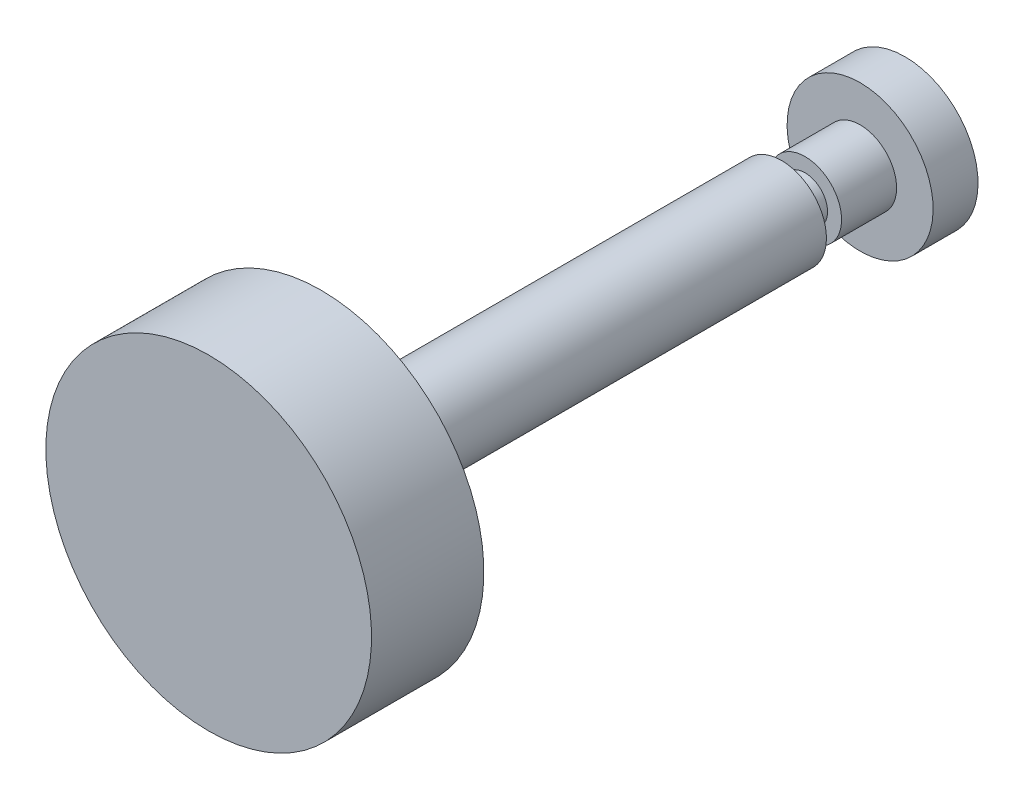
ISO-10303-21;
HEADER;
FILE_DESCRIPTION(('STEP AP214'),'2;1');
FILE_NAME('part.step','',(''),(''),'','','');
FILE_SCHEMA(('AUTOMOTIVE_DESIGN { 1 0 10303 214 1 1 1 1 }'));
ENDSEC;
DATA;
#1=APPLICATION_CONTEXT('core data for automotive mechanical design processes');
#2=APPLICATION_PROTOCOL_DEFINITION('international standard','automotive_design',2000,#1);
#3=PRODUCT_CONTEXT('',#1,'mechanical');
#4=PRODUCT('Part','Part','',(#3));
#5=PRODUCT_RELATED_PRODUCT_CATEGORY('part','',(#4));
#6=PRODUCT_DEFINITION_FORMATION('','',#4);
#7=PRODUCT_DEFINITION_CONTEXT('part definition',#1,'design');
#8=PRODUCT_DEFINITION('design','',#6,#7);
#9=PRODUCT_DEFINITION_SHAPE('','',#8);
#10=(LENGTH_UNIT() NAMED_UNIT(*) SI_UNIT(.MILLI.,.METRE.));
#11=(NAMED_UNIT(*) PLANE_ANGLE_UNIT() SI_UNIT($,.RADIAN.));
#12=(NAMED_UNIT(*) SI_UNIT($,.STERADIAN.) SOLID_ANGLE_UNIT());
#13=UNCERTAINTY_MEASURE_WITH_UNIT(LENGTH_MEASURE(1.E-05),#10,'distance_accuracy_value','');
#14=(GEOMETRIC_REPRESENTATION_CONTEXT(3) GLOBAL_UNCERTAINTY_ASSIGNED_CONTEXT((#13)) GLOBAL_UNIT_ASSIGNED_CONTEXT((#10,
#11,#12)) REPRESENTATION_CONTEXT('',''));
#15=CARTESIAN_POINT('',(0.,0.,0.));
#16=DIRECTION('',(0.,0.,1.));
#17=DIRECTION('',(1.,0.,0.));
#18=AXIS2_PLACEMENT_3D('',#15,#16,#17);
#19=CARTESIAN_POINT('',(0.,0.,0.));
#20=DIRECTION('',(0.,0.,1.));
#21=DIRECTION('',(0.,1.,0.));
#22=AXIS2_PLACEMENT_3D('',#19,#20,#21);
#23=PLANE('',#22);
#24=CARTESIAN_POINT('',(0.,0.,0.));
#25=DIRECTION('',(0.,0.,1.));
#26=DIRECTION('',(0.,1.,0.));
#27=AXIS2_PLACEMENT_3D('',#24,#25,#26);
#28=CIRCLE('',#27,6.5);
#29=CARTESIAN_POINT('',(0.,6.5,0.));
#30=VERTEX_POINT('',#29);
#31=EDGE_CURVE('E8',#30,#30,#28,.T.);
#32=ORIENTED_EDGE('',*,*,#31,.F.);
#33=EDGE_LOOP('',(#32));
#34=FACE_BOUND('',#33,.T.);
#35=ADVANCED_FACE('F12',(#34),#23,.F.);
#36=CARTESIAN_POINT('',(0.,0.,50.));
#37=DIRECTION('',(0.,0.,1.));
#38=DIRECTION('',(0.,1.,0.));
#39=AXIS2_PLACEMENT_3D('',#36,#37,#38);
#40=CYLINDRICAL_SURFACE('',#39,6.5);
#41=CARTESIAN_POINT('',(0.,0.,4.));
#42=DIRECTION('',(0.,0.,1.));
#43=DIRECTION('',(0.,1.,0.));
#44=AXIS2_PLACEMENT_3D('',#41,#42,#43);
#45=CIRCLE('',#44,6.5);
#46=CARTESIAN_POINT('',(0.,6.5,4.));
#47=VERTEX_POINT('',#46);
#48=EDGE_CURVE('E18',#47,#47,#45,.T.);
#49=ORIENTED_EDGE('',*,*,#48,.F.);
#50=EDGE_LOOP('',(#49));
#51=FACE_BOUND('',#50,.T.);
#52=ORIENTED_EDGE('',*,*,#31,.T.);
#53=EDGE_LOOP('',(#52));
#54=FACE_BOUND('',#53,.T.);
#55=ADVANCED_FACE('F71',(#51,#54),#40,.T.);
#56=CARTESIAN_POINT('',(0.,-6.5,4.));
#57=DIRECTION('',(0.,0.,-1.));
#58=DIRECTION('',(0.,-1.,0.));
#59=AXIS2_PLACEMENT_3D('',#56,#57,#58);
#60=PLANE('',#59);
#61=CARTESIAN_POINT('',(0.,0.,4.));
#62=DIRECTION('',(0.,0.,1.));
#63=DIRECTION('',(0.,1.,0.));
#64=AXIS2_PLACEMENT_3D('',#61,#62,#63);
#65=CIRCLE('',#64,3.25);
#66=CARTESIAN_POINT('',(0.,3.25,4.));
#67=VERTEX_POINT('',#66);
#68=EDGE_CURVE('E22',#67,#67,#65,.T.);
#69=ORIENTED_EDGE('',*,*,#68,.F.);
#70=EDGE_LOOP('',(#69));
#71=FACE_BOUND('',#70,.T.);
#72=ORIENTED_EDGE('',*,*,#48,.T.);
#73=EDGE_LOOP('',(#72));
#74=FACE_BOUND('',#73,.T.);
#75=ADVANCED_FACE('F76',(#71,#74),#60,.F.);
#76=CARTESIAN_POINT('',(0.,0.,50.));
#77=DIRECTION('',(0.,0.,1.));
#78=DIRECTION('',(0.,1.,0.));
#79=AXIS2_PLACEMENT_3D('',#76,#77,#78);
#80=CYLINDRICAL_SURFACE('',#79,3.25);
#81=CARTESIAN_POINT('',(0.,0.,8.9));
#82=DIRECTION('',(0.,0.,1.));
#83=DIRECTION('',(0.,1.,0.));
#84=AXIS2_PLACEMENT_3D('',#81,#82,#83);
#85=CIRCLE('',#84,3.25);
#86=CARTESIAN_POINT('',(0.,3.25,8.9));
#87=VERTEX_POINT('',#86);
#88=EDGE_CURVE('E26',#87,#87,#85,.T.);
#89=ORIENTED_EDGE('',*,*,#88,.F.);
#90=EDGE_LOOP('',(#89));
#91=FACE_BOUND('',#90,.T.);
#92=ORIENTED_EDGE('',*,*,#68,.T.);
#93=EDGE_LOOP('',(#92));
#94=FACE_BOUND('',#93,.T.);
#95=ADVANCED_FACE('F81',(#91,#94),#80,.T.);
#96=CARTESIAN_POINT('',(0.,-3.25,8.9));
#97=DIRECTION('',(0.,0.,-1.));
#98=DIRECTION('',(0.,-1.,0.));
#99=AXIS2_PLACEMENT_3D('',#96,#97,#98);
#100=PLANE('',#99);
#101=CARTESIAN_POINT('',(0.,0.,8.9));
#102=DIRECTION('',(0.,0.,1.));
#103=DIRECTION('',(0.,1.,0.));
#104=AXIS2_PLACEMENT_3D('',#101,#102,#103);
#105=CIRCLE('',#104,2.);
#106=CARTESIAN_POINT('',(0.,2.,8.9));
#107=VERTEX_POINT('',#106);
#108=EDGE_CURVE('E31',#107,#107,#105,.T.);
#109=ORIENTED_EDGE('',*,*,#108,.F.);
#110=EDGE_LOOP('',(#109));
#111=FACE_BOUND('',#110,.T.);
#112=ORIENTED_EDGE('',*,*,#88,.T.);
#113=EDGE_LOOP('',(#112));
#114=FACE_BOUND('',#113,.T.);
#115=ADVANCED_FACE('F87',(#111,#114),#100,.F.);
#116=CARTESIAN_POINT('',(0.,0.,50.));
#117=DIRECTION('',(0.,0.,1.));
#118=DIRECTION('',(0.,1.,0.));
#119=AXIS2_PLACEMENT_3D('',#116,#117,#118);
#120=CYLINDRICAL_SURFACE('',#119,2.);
#121=CARTESIAN_POINT('',(0.,0.,11.));
#122=DIRECTION('',(0.,0.,1.));
#123=DIRECTION('',(0.,1.,0.));
#124=AXIS2_PLACEMENT_3D('',#121,#122,#123);
#125=CIRCLE('',#124,2.);
#126=CARTESIAN_POINT('',(0.,2.,11.));
#127=VERTEX_POINT('',#126);
#128=EDGE_CURVE('E34',#127,#127,#125,.T.);
#129=ORIENTED_EDGE('',*,*,#128,.F.);
#130=EDGE_LOOP('',(#129));
#131=FACE_BOUND('',#130,.T.);
#132=ORIENTED_EDGE('',*,*,#108,.T.);
#133=EDGE_LOOP('',(#132));
#134=FACE_BOUND('',#133,.T.);
#135=ADVANCED_FACE('F91',(#131,#134),#120,.T.);
#136=CARTESIAN_POINT('',(0.,-2.,11.));
#137=DIRECTION('',(0.,0.,1.));
#138=DIRECTION('',(0.,1.,0.));
#139=AXIS2_PLACEMENT_3D('',#136,#137,#138);
#140=PLANE('',#139);
#141=CARTESIAN_POINT('',(0.,0.,11.));
#142=DIRECTION('',(0.,0.,1.));
#143=DIRECTION('',(0.,1.,0.));
#144=AXIS2_PLACEMENT_3D('',#141,#142,#143);
#145=CIRCLE('',#144,4.);
#146=CARTESIAN_POINT('',(0.,4.,11.));
#147=VERTEX_POINT('',#146);
#148=EDGE_CURVE('E37',#147,#147,#145,.T.);
#149=ORIENTED_EDGE('',*,*,#148,.F.);
#150=EDGE_LOOP('',(#149));
#151=FACE_BOUND('',#150,.T.);
#152=ORIENTED_EDGE('',*,*,#128,.T.);
#153=EDGE_LOOP('',(#152));
#154=FACE_BOUND('',#153,.T.);
#155=ADVANCED_FACE('F67',(#151,#154),#140,.F.);
#156=CARTESIAN_POINT('',(0.,0.,50.));
#157=DIRECTION('',(0.,0.,1.));
#158=DIRECTION('',(0.,1.,0.));
#159=AXIS2_PLACEMENT_3D('',#156,#157,#158);
#160=CYLINDRICAL_SURFACE('',#159,4.);
#161=CARTESIAN_POINT('',(0.,0.,52.));
#162=DIRECTION('',(0.,0.,1.));
#163=DIRECTION('',(0.,1.,0.));
#164=AXIS2_PLACEMENT_3D('',#161,#162,#163);
#165=CIRCLE('',#164,4.);
#166=CARTESIAN_POINT('',(0.,4.,52.));
#167=VERTEX_POINT('',#166);
#168=EDGE_CURVE('E40',#167,#167,#165,.T.);
#169=ORIENTED_EDGE('',*,*,#168,.F.);
#170=EDGE_LOOP('',(#169));
#171=FACE_BOUND('',#170,.T.);
#172=ORIENTED_EDGE('',*,*,#148,.T.);
#173=EDGE_LOOP('',(#172));
#174=FACE_BOUND('',#173,.T.);
#175=ADVANCED_FACE('F60',(#171,#174),#160,.T.);
#176=CARTESIAN_POINT('',(0.,-14.5,52.));
#177=DIRECTION('',(0.,0.,-1.));
#178=DIRECTION('',(0.,-1.,0.));
#179=AXIS2_PLACEMENT_3D('',#176,#177,#178);
#180=PLANE('',#179);
#181=ORIENTED_EDGE('',*,*,#168,.T.);
#182=EDGE_LOOP('',(#181));
#183=FACE_BOUND('',#182,.T.);
#184=CARTESIAN_POINT('',(0.,0.,52.));
#185=DIRECTION('',(0.,0.,1.));
#186=DIRECTION('',(0.,1.,0.));
#187=AXIS2_PLACEMENT_3D('',#184,#185,#186);
#188=CIRCLE('',#187,14.5);
#189=CARTESIAN_POINT('',(0.,14.5,52.));
#190=VERTEX_POINT('',#189);
#191=EDGE_CURVE('E43',#190,#190,#188,.T.);
#192=ORIENTED_EDGE('',*,*,#191,.F.);
#193=EDGE_LOOP('',(#192));
#194=FACE_BOUND('',#193,.T.);
#195=ADVANCED_FACE('F55',(#183,#194),#180,.T.);
#196=CARTESIAN_POINT('',(0.,0.,50.));
#197=DIRECTION('',(0.,0.,1.));
#198=DIRECTION('',(0.,1.,0.));
#199=AXIS2_PLACEMENT_3D('',#196,#197,#198);
#200=CYLINDRICAL_SURFACE('',#199,14.5);
#201=CARTESIAN_POINT('',(0.,0.,62.));
#202=DIRECTION('',(0.,0.,1.));
#203=DIRECTION('',(0.,1.,0.));
#204=AXIS2_PLACEMENT_3D('',#201,#202,#203);
#205=CIRCLE('',#204,14.5);
#206=CARTESIAN_POINT('',(0.,14.5,62.));
#207=VERTEX_POINT('',#206);
#208=EDGE_CURVE('E46',#207,#207,#205,.T.);
#209=ORIENTED_EDGE('',*,*,#208,.F.);
#210=EDGE_LOOP('',(#209));
#211=FACE_BOUND('',#210,.T.);
#212=ORIENTED_EDGE('',*,*,#191,.T.);
#213=EDGE_LOOP('',(#212));
#214=FACE_BOUND('',#213,.T.);
#215=ADVANCED_FACE('F52',(#211,#214),#200,.T.);
#216=CARTESIAN_POINT('',(0.,-14.5,62.));
#217=DIRECTION('',(0.,0.,-1.));
#218=DIRECTION('',(0.,-1.,0.));
#219=AXIS2_PLACEMENT_3D('',#216,#217,#218);
#220=PLANE('',#219);
#221=ORIENTED_EDGE('',*,*,#208,.T.);
#222=EDGE_LOOP('',(#221));
#223=FACE_BOUND('',#222,.T.);
#224=ADVANCED_FACE('F50',(#223),#220,.F.);
#225=CLOSED_SHELL('',(#35,#55,#75,#95,#115,#135,#155,#175,#195,#215,#224));
#226=MANIFOLD_SOLID_BREP('B1',#225);
#227=ADVANCED_BREP_SHAPE_REPRESENTATION('',(#18,#226),#14);
#228=SHAPE_DEFINITION_REPRESENTATION(#9,#227);
ENDSEC;
END-ISO-10303-21;
